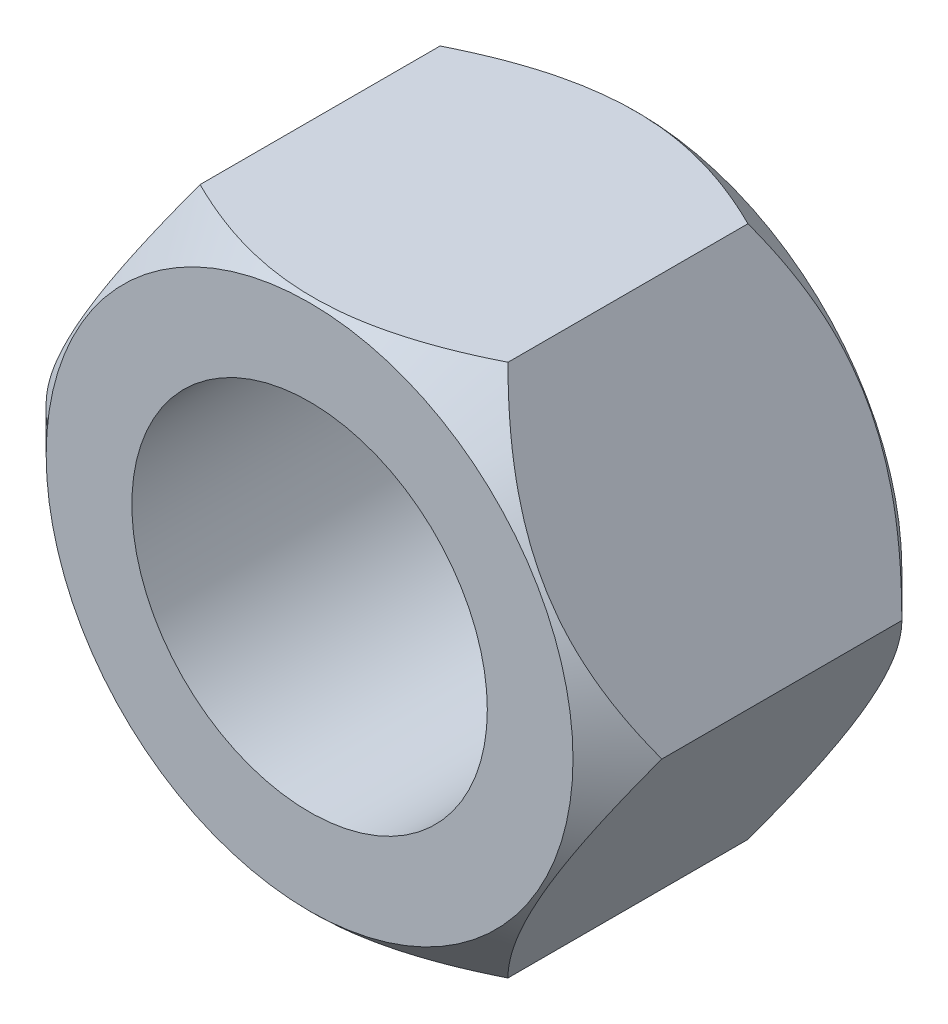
from build123d import *

# Parameters (mm, degrees)
BOSS_EXTRU_1_DEPTH      = 7.4
ESQUISSE2_R             = 8
ENL_V_MAT_EXTRU_1_DEPTH = 24.559286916


with BuildPart() as part:
    # Esquisse1 → Boss.-Extru.1 (new, symmetric)
    with BuildSketch(Plane.XY):
        Polygon((13.856406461, 0), (6.92820323, 12), (-6.92820323, 12), (-13.856406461, 0), (-6.92820323, -12), (6.92820323, -12), align=None)
    extrude(amount=BOSS_EXTRU_1_DEPTH, both=True)

    # Esquisse2 → Enl_v. mat.-Extru.1 (cut, through all)
    with BuildSketch(Plane.XY.offset(7.4)):
        Circle(ESQUISSE2_R)
    extrude(amount=-ENL_V_MAT_EXTRU_1_DEPTH, mode=Mode.SUBTRACT)

    # Esquisse3 → Enl_vement de mati_re-R_volution1 (revolve, cut)
    with BuildSketch(Plane(origin=(0, 0, 0), x_dir=(1, 0, 0), z_dir=(0, 1, 0))):
        Polygon((13.856406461, 7.4), (11.856406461, 7.4), (13.856406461, 5.4), align=None)
    enl_vement_de_mati_re_r_volution1 = revolve(axis=Axis((0, 0, 0), (0, 0, -1)), mode=Mode.SUBTRACT)

    # Sym_trie1: Enl_vement de mati_re-R_volution1 across plane
    add(enl_vement_de_mati_re_r_volution1.mirror(Plane.XY), mode=Mode.SUBTRACT)


solid = part.part
